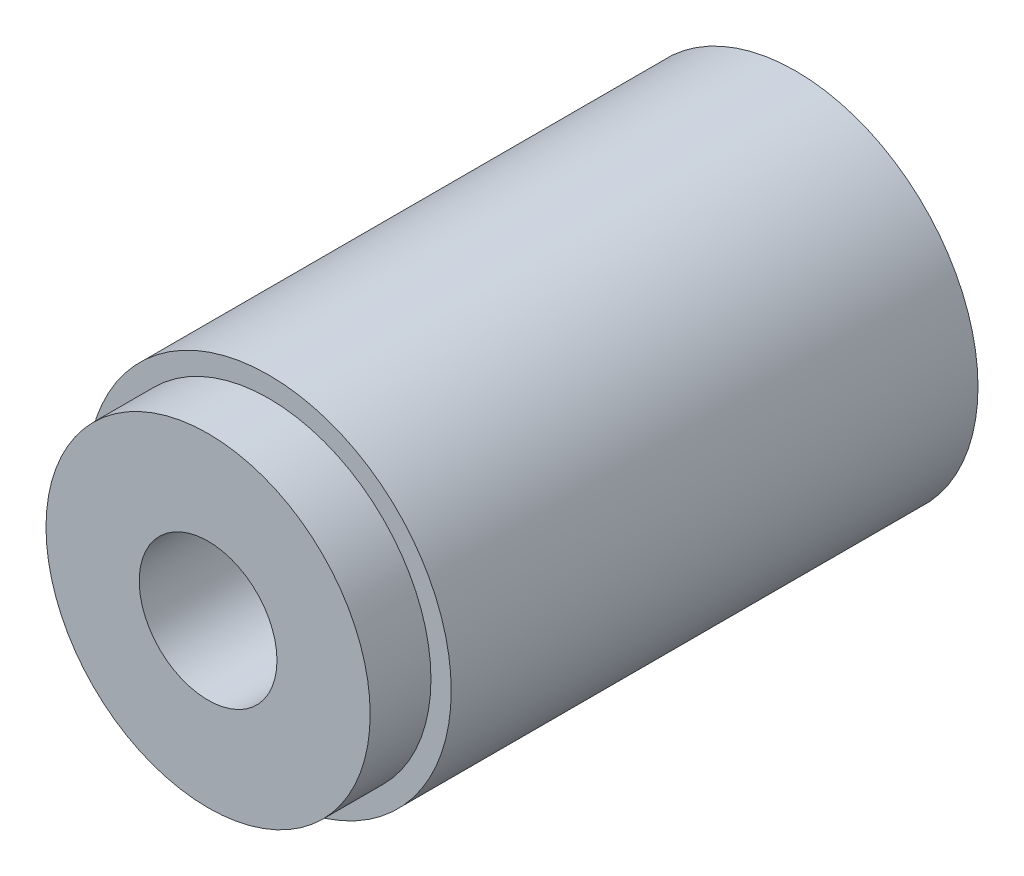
from build123d import *

# Parameters (mm, degrees)
ESQUISSE2_R             = 45
EXTRUSION1_DEPTH        = 130
ESQUISSE3_R             = 40
EXTRUSION2_DEPTH        = 15
ESQUISSE4_R             = 17
ENL_V_MAT_EXTRU_1_DEPTH = 159.350876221


with BuildPart() as part:
    # Esquisse2 → Extrusion1 (new body)
    with BuildSketch(Plane.XY):
        Circle(ESQUISSE2_R)
    extrude(amount=EXTRUSION1_DEPTH)

    # Esquisse3 → Extrusion2 (add)
    with BuildSketch(Plane.XY.offset(130)):
        Circle(ESQUISSE3_R)
    extrude(amount=EXTRUSION2_DEPTH)

    # Esquisse4 → Enl_v. mat.-Extru.1 (cut, through all)
    with BuildSketch(Plane.XY.offset(145)):
        Circle(ESQUISSE4_R)
    extrude(amount=-ENL_V_MAT_EXTRU_1_DEPTH, mode=Mode.SUBTRACT)


solid = part.part
